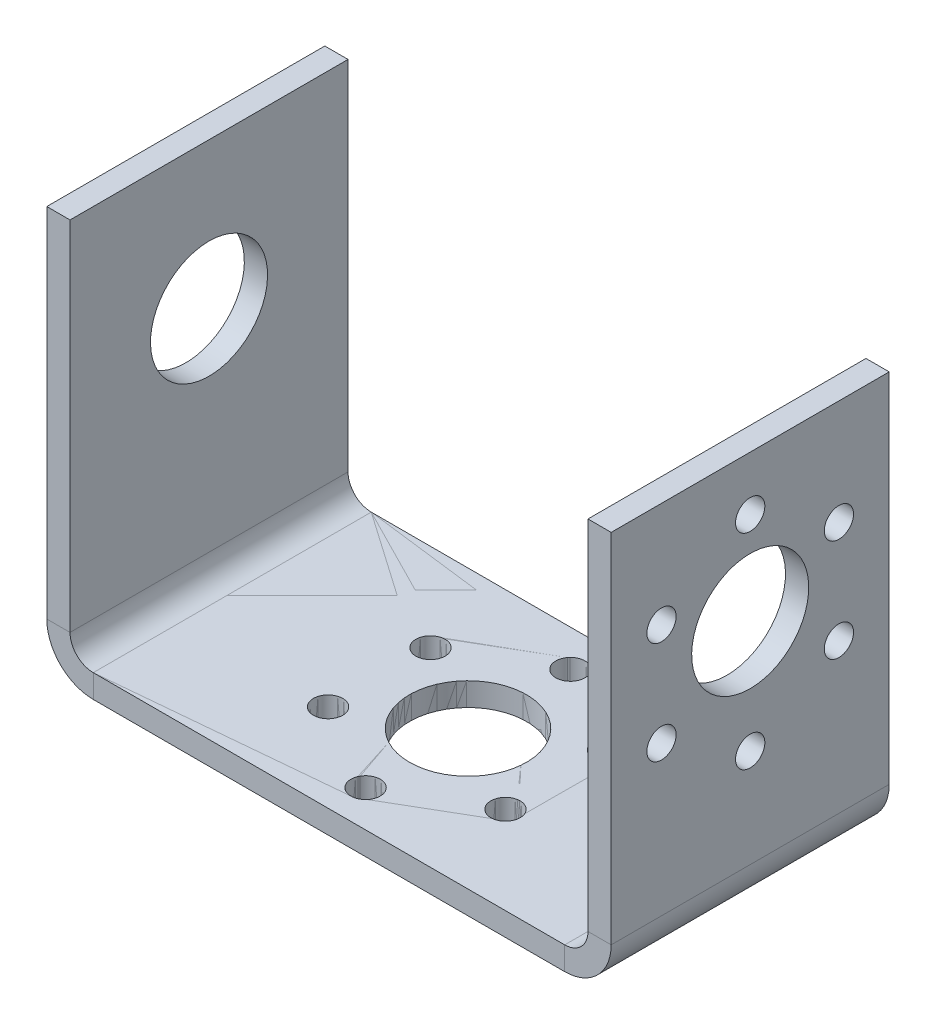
ISO-10303-21;
HEADER;
FILE_DESCRIPTION(('STEP AP214'),'2;1');
FILE_NAME('part.step','',(''),(''),'','','');
FILE_SCHEMA(('AUTOMOTIVE_DESIGN { 1 0 10303 214 1 1 1 1 }'));
ENDSEC;
DATA;
#1=APPLICATION_CONTEXT('core data for automotive mechanical design processes');
#2=APPLICATION_PROTOCOL_DEFINITION('international standard','automotive_design',2000,#1);
#3=PRODUCT_CONTEXT('',#1,'mechanical');
#4=PRODUCT('Part','Part','',(#3));
#5=PRODUCT_RELATED_PRODUCT_CATEGORY('part','',(#4));
#6=PRODUCT_DEFINITION_FORMATION('','',#4);
#7=PRODUCT_DEFINITION_CONTEXT('part definition',#1,'design');
#8=PRODUCT_DEFINITION('design','',#6,#7);
#9=PRODUCT_DEFINITION_SHAPE('','',#8);
#10=(LENGTH_UNIT() NAMED_UNIT(*) SI_UNIT(.MILLI.,.METRE.));
#11=(NAMED_UNIT(*) PLANE_ANGLE_UNIT() SI_UNIT($,.RADIAN.));
#12=(NAMED_UNIT(*) SI_UNIT($,.STERADIAN.) SOLID_ANGLE_UNIT());
#13=UNCERTAINTY_MEASURE_WITH_UNIT(LENGTH_MEASURE(1.E-05),#10,'distance_accuracy_value','');
#14=(GEOMETRIC_REPRESENTATION_CONTEXT(3) GLOBAL_UNCERTAINTY_ASSIGNED_CONTEXT((#13)) GLOBAL_UNIT_ASSIGNED_CONTEXT((#10,
#11,#12)) REPRESENTATION_CONTEXT('',''));
#15=CARTESIAN_POINT('',(0.,0.,0.));
#16=DIRECTION('',(0.,0.,1.));
#17=DIRECTION('',(1.,0.,0.));
#18=AXIS2_PLACEMENT_3D('',#15,#16,#17);
#19=CARTESIAN_POINT('',(0.,1.5875,-19.));
#20=DIRECTION('',(0.,0.,1.));
#21=DIRECTION('',(-1.,0.,0.));
#22=AXIS2_PLACEMENT_3D('',#19,#20,#21);
#23=PLANE('',#22);
#24=DIRECTION('',(0.,1.,0.));
#25=VECTOR('',#24,1.);
#26=CARTESIAN_POINT('',(32.22,1.5875,-19.));
#27=LINE('',#26,#25);
#28=CARTESIAN_POINT('',(32.22,0.,-19.));
#29=VERTEX_POINT('',#28);
#30=CARTESIAN_POINT('',(32.22,1.5875,-19.));
#31=VERTEX_POINT('',#30);
#32=EDGE_CURVE('E117',#29,#31,#27,.T.);
#33=ORIENTED_EDGE('',*,*,#32,.F.);
#34=DIRECTION('',(1.,0.,0.));
#35=VECTOR('',#34,1.);
#36=CARTESIAN_POINT('',(0.,0.,-19.));
#37=LINE('',#36,#35);
#38=CARTESIAN_POINT('',(0.,0.,-19.));
#39=VERTEX_POINT('',#38);
#40=EDGE_CURVE('E290',#29,#39,#37,.F.);
#41=ORIENTED_EDGE('',*,*,#40,.T.);
#42=DIRECTION('',(0.,1.,0.));
#43=VECTOR('',#42,1.);
#44=CARTESIAN_POINT('',(0.,1.5875,-19.));
#45=LINE('',#44,#43);
#46=CARTESIAN_POINT('',(0.,1.5875,-19.));
#47=VERTEX_POINT('',#46);
#48=EDGE_CURVE('E125',#39,#47,#45,.T.);
#49=ORIENTED_EDGE('',*,*,#48,.T.);
#50=DIRECTION('',(-1.,0.,0.));
#51=VECTOR('',#50,1.);
#52=CARTESIAN_POINT('',(0.,1.5875,-19.));
#53=LINE('',#52,#51);
#54=EDGE_CURVE('E189',#31,#47,#53,.T.);
#55=ORIENTED_EDGE('',*,*,#54,.F.);
#56=EDGE_LOOP('',(#33,#41,#49,#55));
#57=FACE_BOUND('',#56,.T.);
#58=ADVANCED_FACE('F107',(#57),#23,.F.);
#59=CARTESIAN_POINT('',(10.0478221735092,1.5875,-5.99999999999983));
#60=DIRECTION('',(0.,1.,0.));
#61=DIRECTION('',(0.,0.,1.));
#62=AXIS2_PLACEMENT_3D('',#59,#60,#61);
#63=CYLINDRICAL_SURFACE('',#62,1.00000000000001);
#64=CARTESIAN_POINT('',(10.0478221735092,1.5875,-5.99999999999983));
#65=DIRECTION('',(0.,1.,0.));
#66=DIRECTION('',(0.,0.,1.));
#67=AXIS2_PLACEMENT_3D('',#64,#65,#66);
#68=CIRCLE('',#67,1.00000000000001);
#69=CARTESIAN_POINT('',(10.0478221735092,1.5875,-4.99999999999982));
#70=VERTEX_POINT('',#69);
#71=EDGE_CURVE('E257',#70,#70,#68,.T.);
#72=ORIENTED_EDGE('',*,*,#71,.T.);
#73=EDGE_LOOP('',(#72));
#74=FACE_BOUND('',#73,.T.);
#75=CARTESIAN_POINT('',(10.0478221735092,0.,-5.99999999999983));
#76=DIRECTION('',(0.,1.,0.));
#77=DIRECTION('',(0.,0.,1.));
#78=AXIS2_PLACEMENT_3D('',#75,#76,#77);
#79=CIRCLE('',#78,1.00000000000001);
#80=CARTESIAN_POINT('',(10.0478221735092,0.,-4.99999999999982));
#81=VERTEX_POINT('',#80);
#82=EDGE_CURVE('E248',#81,#81,#79,.T.);
#83=ORIENTED_EDGE('',*,*,#82,.F.);
#84=EDGE_LOOP('',(#83));
#85=FACE_BOUND('',#84,.T.);
#86=ADVANCED_FACE('F472',(#74,#85),#63,.F.);
#87=CARTESIAN_POINT('',(22.1721778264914,1.5875,-6.00000000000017));
#88=DIRECTION('',(0.,1.,0.));
#89=DIRECTION('',(0.,0.,1.));
#90=AXIS2_PLACEMENT_3D('',#87,#88,#89);
#91=CYLINDRICAL_SURFACE('',#90,1.);
#92=CARTESIAN_POINT('',(22.1721778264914,1.5875,-6.00000000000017));
#93=DIRECTION('',(0.,1.,0.));
#94=DIRECTION('',(0.,0.,1.));
#95=AXIS2_PLACEMENT_3D('',#92,#93,#94);
#96=CIRCLE('',#95,1.);
#97=CARTESIAN_POINT('',(22.1721778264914,1.5875,-5.00000000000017));
#98=VERTEX_POINT('',#97);
#99=EDGE_CURVE('E260',#98,#98,#96,.T.);
#100=ORIENTED_EDGE('',*,*,#99,.T.);
#101=EDGE_LOOP('',(#100));
#102=FACE_BOUND('',#101,.T.);
#103=CARTESIAN_POINT('',(22.1721778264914,0.,-6.00000000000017));
#104=DIRECTION('',(0.,1.,0.));
#105=DIRECTION('',(0.,0.,1.));
#106=AXIS2_PLACEMENT_3D('',#103,#104,#105);
#107=CIRCLE('',#106,1.);
#108=CARTESIAN_POINT('',(22.1721778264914,0.,-5.00000000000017));
#109=VERTEX_POINT('',#108);
#110=EDGE_CURVE('E283',#109,#109,#107,.T.);
#111=ORIENTED_EDGE('',*,*,#110,.F.);
#112=EDGE_LOOP('',(#111));
#113=FACE_BOUND('',#112,.T.);
#114=ADVANCED_FACE('F477',(#102,#113),#91,.F.);
#115=CARTESIAN_POINT('',(16.11,1.5875,-16.5));
#116=DIRECTION('',(0.,1.,0.));
#117=DIRECTION('',(0.,0.,1.));
#118=AXIS2_PLACEMENT_3D('',#115,#116,#117);
#119=CYLINDRICAL_SURFACE('',#118,1.);
#120=CARTESIAN_POINT('',(16.11,1.5875,-16.5));
#121=DIRECTION('',(0.,1.,0.));
#122=DIRECTION('',(0.,0.,1.));
#123=AXIS2_PLACEMENT_3D('',#120,#121,#122);
#124=CIRCLE('',#123,1.);
#125=CARTESIAN_POINT('',(16.11,1.5875,-15.5));
#126=VERTEX_POINT('',#125);
#127=EDGE_CURVE('E264',#126,#126,#124,.T.);
#128=ORIENTED_EDGE('',*,*,#127,.T.);
#129=EDGE_LOOP('',(#128));
#130=FACE_BOUND('',#129,.T.);
#131=CARTESIAN_POINT('',(16.11,0.,-16.5));
#132=DIRECTION('',(0.,1.,0.));
#133=DIRECTION('',(0.,0.,1.));
#134=AXIS2_PLACEMENT_3D('',#131,#132,#133);
#135=CIRCLE('',#134,1.);
#136=CARTESIAN_POINT('',(16.11,0.,-15.5));
#137=VERTEX_POINT('',#136);
#138=EDGE_CURVE('E286',#137,#137,#135,.T.);
#139=ORIENTED_EDGE('',*,*,#138,.F.);
#140=EDGE_LOOP('',(#139));
#141=FACE_BOUND('',#140,.T.);
#142=ADVANCED_FACE('F482',(#130,#141),#119,.F.);
#143=CARTESIAN_POINT('',(0.,1.5875,0.));
#144=DIRECTION('',(0.,0.,-1.));
#145=DIRECTION('',(1.,0.,0.));
#146=AXIS2_PLACEMENT_3D('',#143,#144,#145);
#147=PLANE('',#146);
#148=DIRECTION('',(1.,0.,0.));
#149=VECTOR('',#148,1.);
#150=CARTESIAN_POINT('',(0.,0.,0.));
#151=LINE('',#150,#149);
#152=CARTESIAN_POINT('',(0.,0.,0.));
#153=VERTEX_POINT('',#152);
#154=CARTESIAN_POINT('',(32.22,0.,0.));
#155=VERTEX_POINT('',#154);
#156=EDGE_CURVE('E148',#153,#155,#151,.T.);
#157=ORIENTED_EDGE('',*,*,#156,.T.);
#158=DIRECTION('',(0.,1.,0.));
#159=VECTOR('',#158,1.);
#160=CARTESIAN_POINT('',(32.22,1.5875,0.));
#161=LINE('',#160,#159);
#162=CARTESIAN_POINT('',(32.22,1.5875,0.));
#163=VERTEX_POINT('',#162);
#164=EDGE_CURVE('E14',#155,#163,#161,.T.);
#165=ORIENTED_EDGE('',*,*,#164,.T.);
#166=DIRECTION('',(1.,0.,0.));
#167=VECTOR('',#166,1.);
#168=CARTESIAN_POINT('',(0.,1.5875,0.));
#169=LINE('',#168,#167);
#170=CARTESIAN_POINT('',(0.,1.5875,0.));
#171=VERTEX_POINT('',#170);
#172=EDGE_CURVE('E165',#171,#163,#169,.T.);
#173=ORIENTED_EDGE('',*,*,#172,.F.);
#174=DIRECTION('',(0.,1.,0.));
#175=VECTOR('',#174,1.);
#176=CARTESIAN_POINT('',(0.,1.5875,0.));
#177=LINE('',#176,#175);
#178=EDGE_CURVE('E111',#153,#171,#177,.T.);
#179=ORIENTED_EDGE('',*,*,#178,.F.);
#180=EDGE_LOOP('',(#157,#165,#173,#179));
#181=FACE_BOUND('',#180,.T.);
#182=ADVANCED_FACE('F164',(#181),#147,.F.);
#183=CARTESIAN_POINT('',(16.11,1.5875,-9.5));
#184=DIRECTION('',(0.,1.,0.));
#185=DIRECTION('',(0.,0.,1.));
#186=AXIS2_PLACEMENT_3D('',#183,#184,#185);
#187=CYLINDRICAL_SURFACE('',#186,4.);
#188=CARTESIAN_POINT('',(16.11,1.5875,-9.5));
#189=DIRECTION('',(0.,1.,0.));
#190=DIRECTION('',(0.,0.,1.));
#191=AXIS2_PLACEMENT_3D('',#188,#189,#190);
#192=CIRCLE('',#191,4.);
#193=CARTESIAN_POINT('',(16.11,1.5875,-5.5));
#194=VERTEX_POINT('',#193);
#195=EDGE_CURVE('E269',#194,#194,#192,.T.);
#196=ORIENTED_EDGE('',*,*,#195,.T.);
#197=EDGE_LOOP('',(#196));
#198=FACE_BOUND('',#197,.T.);
#199=CARTESIAN_POINT('',(16.11,0.,-9.5));
#200=DIRECTION('',(0.,1.,0.));
#201=DIRECTION('',(0.,0.,1.));
#202=AXIS2_PLACEMENT_3D('',#199,#200,#201);
#203=CIRCLE('',#202,4.);
#204=CARTESIAN_POINT('',(16.11,0.,-5.5));
#205=VERTEX_POINT('',#204);
#206=EDGE_CURVE('E292',#205,#205,#203,.T.);
#207=ORIENTED_EDGE('',*,*,#206,.F.);
#208=EDGE_LOOP('',(#207));
#209=FACE_BOUND('',#208,.T.);
#210=ADVANCED_FACE('F486',(#198,#209),#187,.F.);
#211=CARTESIAN_POINT('',(22.1721778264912,1.5875,-13.0000000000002));
#212=DIRECTION('',(0.,1.,0.));
#213=DIRECTION('',(0.,0.,1.));
#214=AXIS2_PLACEMENT_3D('',#211,#212,#213);
#215=CYLINDRICAL_SURFACE('',#214,1.);
#216=CARTESIAN_POINT('',(22.1721778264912,1.5875,-13.0000000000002));
#217=DIRECTION('',(0.,1.,0.));
#218=DIRECTION('',(0.,0.,1.));
#219=AXIS2_PLACEMENT_3D('',#216,#217,#218);
#220=CIRCLE('',#219,1.);
#221=CARTESIAN_POINT('',(22.1721778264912,1.5875,-12.0000000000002));
#222=VERTEX_POINT('',#221);
#223=EDGE_CURVE('E272',#222,#222,#220,.T.);
#224=ORIENTED_EDGE('',*,*,#223,.T.);
#225=EDGE_LOOP('',(#224));
#226=FACE_BOUND('',#225,.T.);
#227=CARTESIAN_POINT('',(22.1721778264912,0.,-13.0000000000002));
#228=DIRECTION('',(0.,1.,0.));
#229=DIRECTION('',(0.,0.,1.));
#230=AXIS2_PLACEMENT_3D('',#227,#228,#229);
#231=CIRCLE('',#230,1.);
#232=CARTESIAN_POINT('',(22.1721778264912,0.,-12.0000000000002));
#233=VERTEX_POINT('',#232);
#234=EDGE_CURVE('E297',#233,#233,#231,.T.);
#235=ORIENTED_EDGE('',*,*,#234,.F.);
#236=EDGE_LOOP('',(#235));
#237=FACE_BOUND('',#236,.T.);
#238=ADVANCED_FACE('F489',(#226,#237),#215,.F.);
#239=CARTESIAN_POINT('',(16.1100000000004,1.5875,-2.5));
#240=DIRECTION('',(0.,1.,0.));
#241=DIRECTION('',(0.,0.,1.));
#242=AXIS2_PLACEMENT_3D('',#239,#240,#241);
#243=CYLINDRICAL_SURFACE('',#242,1.00000000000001);
#244=CARTESIAN_POINT('',(16.1100000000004,1.5875,-2.5));
#245=DIRECTION('',(0.,1.,0.));
#246=DIRECTION('',(0.,0.,1.));
#247=AXIS2_PLACEMENT_3D('',#244,#245,#246);
#248=CIRCLE('',#247,1.00000000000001);
#249=CARTESIAN_POINT('',(16.1100000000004,1.5875,-1.49999999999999));
#250=VERTEX_POINT('',#249);
#251=EDGE_CURVE('E275',#250,#250,#248,.T.);
#252=ORIENTED_EDGE('',*,*,#251,.T.);
#253=EDGE_LOOP('',(#252));
#254=FACE_BOUND('',#253,.T.);
#255=CARTESIAN_POINT('',(16.1100000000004,0.,-2.5));
#256=DIRECTION('',(0.,1.,0.));
#257=DIRECTION('',(0.,0.,1.));
#258=AXIS2_PLACEMENT_3D('',#255,#256,#257);
#259=CIRCLE('',#258,1.00000000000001);
#260=CARTESIAN_POINT('',(16.1100000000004,0.,-1.49999999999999));
#261=VERTEX_POINT('',#260);
#262=EDGE_CURVE('E300',#261,#261,#259,.T.);
#263=ORIENTED_EDGE('',*,*,#262,.F.);
#264=EDGE_LOOP('',(#263));
#265=FACE_BOUND('',#264,.T.);
#266=ADVANCED_FACE('F492',(#254,#265),#243,.F.);
#267=CARTESIAN_POINT('',(10.047822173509,1.5875,-12.9999999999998));
#268=DIRECTION('',(0.,1.,0.));
#269=DIRECTION('',(0.,0.,1.));
#270=AXIS2_PLACEMENT_3D('',#267,#268,#269);
#271=CYLINDRICAL_SURFACE('',#270,1.);
#272=CARTESIAN_POINT('',(10.047822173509,1.5875,-12.9999999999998));
#273=DIRECTION('',(0.,1.,0.));
#274=DIRECTION('',(0.,0.,1.));
#275=AXIS2_PLACEMENT_3D('',#272,#273,#274);
#276=CIRCLE('',#275,1.);
#277=CARTESIAN_POINT('',(10.047822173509,1.5875,-11.9999999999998));
#278=VERTEX_POINT('',#277);
#279=EDGE_CURVE('E278',#278,#278,#276,.T.);
#280=ORIENTED_EDGE('',*,*,#279,.T.);
#281=EDGE_LOOP('',(#280));
#282=FACE_BOUND('',#281,.T.);
#283=CARTESIAN_POINT('',(10.047822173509,0.,-12.9999999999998));
#284=DIRECTION('',(0.,1.,0.));
#285=DIRECTION('',(0.,0.,1.));
#286=AXIS2_PLACEMENT_3D('',#283,#284,#285);
#287=CIRCLE('',#286,1.);
#288=CARTESIAN_POINT('',(10.047822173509,0.,-11.9999999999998));
#289=VERTEX_POINT('',#288);
#290=EDGE_CURVE('E261',#289,#289,#287,.T.);
#291=ORIENTED_EDGE('',*,*,#290,.F.);
#292=EDGE_LOOP('',(#291));
#293=FACE_BOUND('',#292,.T.);
#294=ADVANCED_FACE('F109',(#282,#293),#271,.F.);
#295=CARTESIAN_POINT('',(0.,1.5875,0.));
#296=DIRECTION('',(0.,-1.,0.));
#297=DIRECTION('',(0.,0.,-1.));
#298=AXIS2_PLACEMENT_3D('',#295,#296,#297);
#299=PLANE('',#298);
#300=ORIENTED_EDGE('',*,*,#71,.F.);
#301=EDGE_LOOP('',(#300));
#302=FACE_BOUND('',#301,.T.);
#303=ORIENTED_EDGE('',*,*,#99,.F.);
#304=EDGE_LOOP('',(#303));
#305=FACE_BOUND('',#304,.T.);
#306=ORIENTED_EDGE('',*,*,#127,.F.);
#307=EDGE_LOOP('',(#306));
#308=FACE_BOUND('',#307,.T.);
#309=DIRECTION('',(0.,0.,1.));
#310=VECTOR('',#309,1.);
#311=CARTESIAN_POINT('',(0.,1.5875,0.));
#312=LINE('',#311,#310);
#313=EDGE_CURVE('E177',#47,#171,#312,.T.);
#314=ORIENTED_EDGE('',*,*,#313,.T.);
#315=ORIENTED_EDGE('',*,*,#172,.T.);
#316=DIRECTION('',(0.,0.,-1.));
#317=VECTOR('',#316,1.);
#318=CARTESIAN_POINT('',(32.22,1.5875,0.));
#319=LINE('',#318,#317);
#320=EDGE_CURVE('E175',#163,#31,#319,.T.);
#321=ORIENTED_EDGE('',*,*,#320,.T.);
#322=ORIENTED_EDGE('',*,*,#54,.T.);
#323=EDGE_LOOP('',(#314,#315,#321,#322));
#324=FACE_BOUND('',#323,.T.);
#325=ORIENTED_EDGE('',*,*,#195,.F.);
#326=EDGE_LOOP('',(#325));
#327=FACE_BOUND('',#326,.T.);
#328=ORIENTED_EDGE('',*,*,#223,.F.);
#329=EDGE_LOOP('',(#328));
#330=FACE_BOUND('',#329,.T.);
#331=ORIENTED_EDGE('',*,*,#251,.F.);
#332=EDGE_LOOP('',(#331));
#333=FACE_BOUND('',#332,.T.);
#334=ORIENTED_EDGE('',*,*,#279,.F.);
#335=EDGE_LOOP('',(#334));
#336=FACE_BOUND('',#335,.T.);
#337=ADVANCED_FACE('F173',(#302,#305,#308,#324,#327,#330,#333,#336),#299,.F.);
#338=CARTESIAN_POINT('',(0.,0.,0.));
#339=DIRECTION('',(0.,-1.,0.));
#340=DIRECTION('',(0.,0.,-1.));
#341=AXIS2_PLACEMENT_3D('',#338,#339,#340);
#342=PLANE('',#341);
#343=ORIENTED_EDGE('',*,*,#82,.T.);
#344=EDGE_LOOP('',(#343));
#345=FACE_BOUND('',#344,.T.);
#346=ORIENTED_EDGE('',*,*,#110,.T.);
#347=EDGE_LOOP('',(#346));
#348=FACE_BOUND('',#347,.T.);
#349=ORIENTED_EDGE('',*,*,#138,.T.);
#350=EDGE_LOOP('',(#349));
#351=FACE_BOUND('',#350,.T.);
#352=DIRECTION('',(0.,0.,-1.));
#353=VECTOR('',#352,1.);
#354=CARTESIAN_POINT('',(0.,0.,0.));
#355=LINE('',#354,#353);
#356=EDGE_CURVE('E138',#39,#153,#355,.F.);
#357=ORIENTED_EDGE('',*,*,#356,.F.);
#358=ORIENTED_EDGE('',*,*,#40,.F.);
#359=DIRECTION('',(0.,0.,-1.));
#360=VECTOR('',#359,1.);
#361=CARTESIAN_POINT('',(32.22,0.,0.));
#362=LINE('',#361,#360);
#363=EDGE_CURVE('E144',#155,#29,#362,.T.);
#364=ORIENTED_EDGE('',*,*,#363,.F.);
#365=ORIENTED_EDGE('',*,*,#156,.F.);
#366=EDGE_LOOP('',(#357,#358,#364,#365));
#367=FACE_BOUND('',#366,.T.);
#368=ORIENTED_EDGE('',*,*,#206,.T.);
#369=EDGE_LOOP('',(#368));
#370=FACE_BOUND('',#369,.T.);
#371=ORIENTED_EDGE('',*,*,#234,.T.);
#372=EDGE_LOOP('',(#371));
#373=FACE_BOUND('',#372,.T.);
#374=ORIENTED_EDGE('',*,*,#262,.T.);
#375=EDGE_LOOP('',(#374));
#376=FACE_BOUND('',#375,.T.);
#377=ORIENTED_EDGE('',*,*,#290,.T.);
#378=EDGE_LOOP('',(#377));
#379=FACE_BOUND('',#378,.T.);
#380=ADVANCED_FACE('F504',(#345,#348,#351,#367,#370,#373,#376,#379),#342,.T.);
#381=CARTESIAN_POINT('',(0.,3.175,-19.));
#382=DIRECTION('',(0.,0.,-1.));
#383=DIRECTION('',(-1.,0.,0.));
#384=AXIS2_PLACEMENT_3D('',#381,#382,#383);
#385=PLANE('',#384);
#386=DIRECTION('',(1.,0.,0.));
#387=VECTOR('',#386,1.);
#388=CARTESIAN_POINT('',(-3.175,3.17499999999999,-19.));
#389=LINE('',#388,#387);
#390=CARTESIAN_POINT('',(-1.5875,3.17499999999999,-19.));
#391=VERTEX_POINT('',#390);
#392=CARTESIAN_POINT('',(-3.175,3.17499999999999,-19.));
#393=VERTEX_POINT('',#392);
#394=EDGE_CURVE('E242',#391,#393,#389,.F.);
#395=ORIENTED_EDGE('',*,*,#394,.F.);
#396=CARTESIAN_POINT('',(0.,3.175,-19.));
#397=DIRECTION('',(0.,0.,1.));
#398=DIRECTION('',(1.,0.,0.));
#399=AXIS2_PLACEMENT_3D('',#396,#397,#398);
#400=CIRCLE('',#399,1.5875);
#401=EDGE_CURVE('E252',#47,#391,#400,.F.);
#402=ORIENTED_EDGE('',*,*,#401,.F.);
#403=ORIENTED_EDGE('',*,*,#48,.F.);
#404=CARTESIAN_POINT('',(0.,3.175,-19.));
#405=DIRECTION('',(0.,0.,1.));
#406=DIRECTION('',(1.,0.,0.));
#407=AXIS2_PLACEMENT_3D('',#404,#405,#406);
#408=CIRCLE('',#407,3.175);
#409=EDGE_CURVE('E245',#39,#393,#408,.F.);
#410=ORIENTED_EDGE('',*,*,#409,.T.);
#411=EDGE_LOOP('',(#395,#402,#403,#410));
#412=FACE_BOUND('',#411,.T.);
#413=ADVANCED_FACE('F451',(#412),#385,.T.);
#414=CARTESIAN_POINT('',(0.,3.175,0.));
#415=DIRECTION('',(0.,0.,-1.));
#416=DIRECTION('',(-1.,0.,0.));
#417=AXIS2_PLACEMENT_3D('',#414,#415,#416);
#418=PLANE('',#417);
#419=CARTESIAN_POINT('',(0.,3.175,0.));
#420=DIRECTION('',(0.,0.,1.));
#421=DIRECTION('',(1.,0.,0.));
#422=AXIS2_PLACEMENT_3D('',#419,#420,#421);
#423=CIRCLE('',#422,1.5875);
#424=CARTESIAN_POINT('',(-1.5875,3.17499999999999,0.));
#425=VERTEX_POINT('',#424);
#426=EDGE_CURVE('E207',#425,#171,#423,.T.);
#427=ORIENTED_EDGE('',*,*,#426,.F.);
#428=DIRECTION('',(1.,0.,0.));
#429=VECTOR('',#428,1.);
#430=CARTESIAN_POINT('',(-1.5875,3.17499999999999,0.));
#431=LINE('',#430,#429);
#432=CARTESIAN_POINT('',(-3.175,3.17499999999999,0.));
#433=VERTEX_POINT('',#432);
#434=EDGE_CURVE('E237',#425,#433,#431,.F.);
#435=ORIENTED_EDGE('',*,*,#434,.T.);
#436=CARTESIAN_POINT('',(0.,3.175,0.));
#437=DIRECTION('',(0.,0.,1.));
#438=DIRECTION('',(1.,0.,0.));
#439=AXIS2_PLACEMENT_3D('',#436,#437,#438);
#440=CIRCLE('',#439,3.175);
#441=EDGE_CURVE('E249',#433,#153,#440,.T.);
#442=ORIENTED_EDGE('',*,*,#441,.T.);
#443=ORIENTED_EDGE('',*,*,#178,.T.);
#444=EDGE_LOOP('',(#427,#435,#442,#443));
#445=FACE_BOUND('',#444,.T.);
#446=ADVANCED_FACE('F436',(#445),#418,.F.);
#447=CARTESIAN_POINT('',(0.,3.175,0.));
#448=DIRECTION('',(0.,0.,1.));
#449=DIRECTION('',(-1.,0.,0.));
#450=AXIS2_PLACEMENT_3D('',#447,#448,#449);
#451=CYLINDRICAL_SURFACE('',#450,3.175);
#452=ORIENTED_EDGE('',*,*,#356,.T.);
#453=ORIENTED_EDGE('',*,*,#441,.F.);
#454=DIRECTION('',(0.,0.,1.));
#455=VECTOR('',#454,1.);
#456=CARTESIAN_POINT('',(-3.175,3.17499999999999,-19.));
#457=LINE('',#456,#455);
#458=EDGE_CURVE('E235',#433,#393,#457,.F.);
#459=ORIENTED_EDGE('',*,*,#458,.T.);
#460=ORIENTED_EDGE('',*,*,#409,.F.);
#461=EDGE_LOOP('',(#452,#453,#459,#460));
#462=FACE_BOUND('',#461,.T.);
#463=ADVANCED_FACE('F429',(#462),#451,.T.);
#464=CARTESIAN_POINT('',(0.,3.175,0.));
#465=DIRECTION('',(0.,0.,1.));
#466=DIRECTION('',(-1.,0.,0.));
#467=AXIS2_PLACEMENT_3D('',#464,#465,#466);
#468=CYLINDRICAL_SURFACE('',#467,1.5875);
#469=ORIENTED_EDGE('',*,*,#313,.F.);
#470=ORIENTED_EDGE('',*,*,#401,.T.);
#471=DIRECTION('',(0.,0.,1.));
#472=VECTOR('',#471,1.);
#473=CARTESIAN_POINT('',(-1.5875,3.17499999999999,-19.));
#474=LINE('',#473,#472);
#475=EDGE_CURVE('E240',#391,#425,#474,.T.);
#476=ORIENTED_EDGE('',*,*,#475,.T.);
#477=ORIENTED_EDGE('',*,*,#426,.T.);
#478=EDGE_LOOP('',(#469,#470,#476,#477));
#479=FACE_BOUND('',#478,.T.);
#480=ADVANCED_FACE('F454',(#479),#468,.F.);
#481=CARTESIAN_POINT('',(-3.17499999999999,0.,0.));
#482=DIRECTION('',(1.,0.,0.));
#483=DIRECTION('',(0.,1.,0.));
#484=AXIS2_PLACEMENT_3D('',#481,#482,#483);
#485=PLANE('',#484);
#486=CARTESIAN_POINT('',(-3.17500000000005,17.5875,-9.5));
#487=DIRECTION('',(1.,0.,0.));
#488=DIRECTION('',(0.,1.,0.));
#489=AXIS2_PLACEMENT_3D('',#486,#487,#488);
#490=CIRCLE('',#489,4.);
#491=CARTESIAN_POINT('',(-3.17500000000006,21.5875,-9.5));
#492=VERTEX_POINT('',#491);
#493=EDGE_CURVE('E229',#492,#492,#490,.F.);
#494=ORIENTED_EDGE('',*,*,#493,.F.);
#495=EDGE_LOOP('',(#494));
#496=FACE_BOUND('',#495,.T.);
#497=ORIENTED_EDGE('',*,*,#458,.F.);
#498=DIRECTION('',(0.,1.,0.));
#499=VECTOR('',#498,1.);
#500=CARTESIAN_POINT('',(-3.17499999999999,0.,0.));
#501=LINE('',#500,#499);
#502=CARTESIAN_POINT('',(-3.17500000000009,27.5875,0.));
#503=VERTEX_POINT('',#502);
#504=EDGE_CURVE('E214',#433,#503,#501,.T.);
#505=ORIENTED_EDGE('',*,*,#504,.T.);
#506=DIRECTION('',(0.,0.,-1.));
#507=VECTOR('',#506,1.);
#508=CARTESIAN_POINT('',(-3.17500000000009,27.5875,0.));
#509=LINE('',#508,#507);
#510=CARTESIAN_POINT('',(-3.17500000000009,27.5875,-19.));
#511=VERTEX_POINT('',#510);
#512=EDGE_CURVE('E211',#503,#511,#509,.T.);
#513=ORIENTED_EDGE('',*,*,#512,.T.);
#514=DIRECTION('',(0.,-1.,0.));
#515=VECTOR('',#514,1.);
#516=CARTESIAN_POINT('',(-3.17499999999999,0.,-19.));
#517=LINE('',#516,#515);
#518=EDGE_CURVE('E217',#511,#393,#517,.T.);
#519=ORIENTED_EDGE('',*,*,#518,.T.);
#520=EDGE_LOOP('',(#497,#505,#513,#519));
#521=FACE_BOUND('',#520,.T.);
#522=ADVANCED_FACE('F443',(#496,#521),#485,.F.);
#523=CARTESIAN_POINT('',(-1.58749999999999,0.,0.));
#524=DIRECTION('',(1.,0.,0.));
#525=DIRECTION('',(0.,1.,0.));
#526=AXIS2_PLACEMENT_3D('',#523,#524,#525);
#527=PLANE('',#526);
#528=CARTESIAN_POINT('',(-1.58750000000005,17.5875,-9.5));
#529=DIRECTION('',(1.,0.,0.));
#530=DIRECTION('',(0.,1.,0.));
#531=AXIS2_PLACEMENT_3D('',#528,#529,#530);
#532=CIRCLE('',#531,4.);
#533=CARTESIAN_POINT('',(-1.58750000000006,21.5875,-9.5));
#534=VERTEX_POINT('',#533);
#535=EDGE_CURVE('E232',#534,#534,#532,.F.);
#536=ORIENTED_EDGE('',*,*,#535,.T.);
#537=EDGE_LOOP('',(#536));
#538=FACE_BOUND('',#537,.T.);
#539=DIRECTION('',(0.,-1.,0.));
#540=VECTOR('',#539,1.);
#541=CARTESIAN_POINT('',(-1.58750000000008,27.5875,0.));
#542=LINE('',#541,#540);
#543=CARTESIAN_POINT('',(-1.58750000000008,27.5875,0.));
#544=VERTEX_POINT('',#543);
#545=EDGE_CURVE('E223',#425,#544,#542,.F.);
#546=ORIENTED_EDGE('',*,*,#545,.F.);
#547=ORIENTED_EDGE('',*,*,#475,.F.);
#548=DIRECTION('',(0.,1.,0.));
#549=VECTOR('',#548,1.);
#550=CARTESIAN_POINT('',(-1.58749999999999,1.5875,-19.));
#551=LINE('',#550,#549);
#552=CARTESIAN_POINT('',(-1.58750000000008,27.5875,-19.));
#553=VERTEX_POINT('',#552);
#554=EDGE_CURVE('E226',#553,#391,#551,.F.);
#555=ORIENTED_EDGE('',*,*,#554,.F.);
#556=DIRECTION('',(0.,0.,1.));
#557=VECTOR('',#556,1.);
#558=CARTESIAN_POINT('',(-1.58750000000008,27.5875,-19.));
#559=LINE('',#558,#557);
#560=EDGE_CURVE('E220',#544,#553,#559,.F.);
#561=ORIENTED_EDGE('',*,*,#560,.F.);
#562=EDGE_LOOP('',(#546,#547,#555,#561));
#563=FACE_BOUND('',#562,.T.);
#564=ADVANCED_FACE('F456',(#538,#563),#527,.T.);
#565=CARTESIAN_POINT('',(-3.17499999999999,1.58749999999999,-19.));
#566=DIRECTION('',(0.,0.,1.));
#567=DIRECTION('',(1.,0.,0.));
#568=AXIS2_PLACEMENT_3D('',#565,#566,#567);
#569=PLANE('',#568);
#570=ORIENTED_EDGE('',*,*,#394,.T.);
#571=ORIENTED_EDGE('',*,*,#518,.F.);
#572=DIRECTION('',(1.,0.,0.));
#573=VECTOR('',#572,1.);
#574=CARTESIAN_POINT('',(-3.17500000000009,27.5875,-19.));
#575=LINE('',#574,#573);
#576=EDGE_CURVE('E208',#511,#553,#575,.T.);
#577=ORIENTED_EDGE('',*,*,#576,.T.);
#578=ORIENTED_EDGE('',*,*,#554,.T.);
#579=EDGE_LOOP('',(#570,#571,#577,#578));
#580=FACE_BOUND('',#579,.T.);
#581=ADVANCED_FACE('F447',(#580),#569,.F.);
#582=CARTESIAN_POINT('',(-3.17500000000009,27.5875,0.));
#583=DIRECTION('',(0.,0.,-1.));
#584=DIRECTION('',(0.,1.,0.));
#585=AXIS2_PLACEMENT_3D('',#582,#583,#584);
#586=PLANE('',#585);
#587=ORIENTED_EDGE('',*,*,#434,.F.);
#588=ORIENTED_EDGE('',*,*,#545,.T.);
#589=DIRECTION('',(1.,0.,0.));
#590=VECTOR('',#589,1.);
#591=CARTESIAN_POINT('',(-3.17500000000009,27.5875,0.));
#592=LINE('',#591,#590);
#593=EDGE_CURVE('E204',#503,#544,#592,.T.);
#594=ORIENTED_EDGE('',*,*,#593,.F.);
#595=ORIENTED_EDGE('',*,*,#504,.F.);
#596=EDGE_LOOP('',(#587,#588,#594,#595));
#597=FACE_BOUND('',#596,.T.);
#598=ADVANCED_FACE('F440',(#597),#586,.F.);
#599=CARTESIAN_POINT('',(-3.17500000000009,27.5875,-19.));
#600=DIRECTION('',(0.,-1.,0.));
#601=DIRECTION('',(1.,0.,0.));
#602=AXIS2_PLACEMENT_3D('',#599,#600,#601);
#603=PLANE('',#602);
#604=ORIENTED_EDGE('',*,*,#560,.T.);
#605=ORIENTED_EDGE('',*,*,#576,.F.);
#606=ORIENTED_EDGE('',*,*,#512,.F.);
#607=ORIENTED_EDGE('',*,*,#593,.T.);
#608=EDGE_LOOP('',(#604,#605,#606,#607));
#609=FACE_BOUND('',#608,.T.);
#610=ADVANCED_FACE('F459',(#609),#603,.F.);
#611=CARTESIAN_POINT('',(-3.17500000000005,17.5875,-9.5));
#612=DIRECTION('',(1.,0.,0.));
#613=DIRECTION('',(0.,1.,0.));
#614=AXIS2_PLACEMENT_3D('',#611,#612,#613);
#615=CYLINDRICAL_SURFACE('',#614,4.);
#616=ORIENTED_EDGE('',*,*,#493,.T.);
#617=EDGE_LOOP('',(#616));
#618=FACE_BOUND('',#617,.T.);
#619=ORIENTED_EDGE('',*,*,#535,.F.);
#620=EDGE_LOOP('',(#619));
#621=FACE_BOUND('',#620,.T.);
#622=ADVANCED_FACE('F461',(#618,#621),#615,.F.);
#623=CARTESIAN_POINT('',(32.22,3.175,0.));
#624=DIRECTION('',(0.,0.,1.));
#625=DIRECTION('',(1.,0.,0.));
#626=AXIS2_PLACEMENT_3D('',#623,#624,#625);
#627=PLANE('',#626);
#628=DIRECTION('',(-1.,0.,0.));
#629=VECTOR('',#628,1.);
#630=CARTESIAN_POINT('',(35.395,3.17499999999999,0.));
#631=LINE('',#630,#629);
#632=CARTESIAN_POINT('',(33.8075,3.17499999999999,0.));
#633=VERTEX_POINT('',#632);
#634=CARTESIAN_POINT('',(35.395,3.17499999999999,0.));
#635=VERTEX_POINT('',#634);
#636=EDGE_CURVE('E194',#633,#635,#631,.F.);
#637=ORIENTED_EDGE('',*,*,#636,.F.);
#638=CARTESIAN_POINT('',(32.22,3.175,0.));
#639=DIRECTION('',(0.,0.,-1.));
#640=DIRECTION('',(-1.,0.,0.));
#641=AXIS2_PLACEMENT_3D('',#638,#639,#640);
#642=CIRCLE('',#641,1.5875);
#643=EDGE_CURVE('E185',#163,#633,#642,.F.);
#644=ORIENTED_EDGE('',*,*,#643,.F.);
#645=ORIENTED_EDGE('',*,*,#164,.F.);
#646=CARTESIAN_POINT('',(32.22,3.175,0.));
#647=DIRECTION('',(0.,0.,-1.));
#648=DIRECTION('',(-1.,0.,0.));
#649=AXIS2_PLACEMENT_3D('',#646,#647,#648);
#650=CIRCLE('',#649,3.175);
#651=EDGE_CURVE('E198',#155,#635,#650,.F.);
#652=ORIENTED_EDGE('',*,*,#651,.T.);
#653=EDGE_LOOP('',(#637,#644,#645,#652));
#654=FACE_BOUND('',#653,.T.);
#655=ADVANCED_FACE('F192',(#654),#627,.T.);
#656=CARTESIAN_POINT('',(32.22,3.175,-19.));
#657=DIRECTION('',(0.,0.,1.));
#658=DIRECTION('',(1.,0.,0.));
#659=AXIS2_PLACEMENT_3D('',#656,#657,#658);
#660=PLANE('',#659);
#661=CARTESIAN_POINT('',(32.22,3.175,-19.));
#662=DIRECTION('',(0.,0.,-1.));
#663=DIRECTION('',(-1.,0.,0.));
#664=AXIS2_PLACEMENT_3D('',#661,#662,#663);
#665=CIRCLE('',#664,1.5875);
#666=CARTESIAN_POINT('',(33.8075,3.17499999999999,-19.));
#667=VERTEX_POINT('',#666);
#668=EDGE_CURVE('E188',#667,#31,#665,.T.);
#669=ORIENTED_EDGE('',*,*,#668,.F.);
#670=DIRECTION('',(-1.,0.,0.));
#671=VECTOR('',#670,1.);
#672=CARTESIAN_POINT('',(33.8075,3.17499999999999,-19.));
#673=LINE('',#672,#671);
#674=CARTESIAN_POINT('',(35.395,3.17499999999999,-19.));
#675=VERTEX_POINT('',#674);
#676=EDGE_CURVE('E328',#667,#675,#673,.F.);
#677=ORIENTED_EDGE('',*,*,#676,.T.);
#678=CARTESIAN_POINT('',(32.22,3.175,-19.));
#679=DIRECTION('',(0.,0.,-1.));
#680=DIRECTION('',(-1.,0.,0.));
#681=AXIS2_PLACEMENT_3D('',#678,#679,#680);
#682=CIRCLE('',#681,3.175);
#683=EDGE_CURVE('E195',#675,#29,#682,.T.);
#684=ORIENTED_EDGE('',*,*,#683,.T.);
#685=ORIENTED_EDGE('',*,*,#32,.T.);
#686=EDGE_LOOP('',(#669,#677,#684,#685));
#687=FACE_BOUND('',#686,.T.);
#688=ADVANCED_FACE('F309',(#687),#660,.F.);
#689=CARTESIAN_POINT('',(32.22,3.175,-19.));
#690=DIRECTION('',(0.,0.,-1.));
#691=DIRECTION('',(1.,0.,0.));
#692=AXIS2_PLACEMENT_3D('',#689,#690,#691);
#693=CYLINDRICAL_SURFACE('',#692,3.175);
#694=ORIENTED_EDGE('',*,*,#363,.T.);
#695=ORIENTED_EDGE('',*,*,#683,.F.);
#696=DIRECTION('',(0.,0.,-1.));
#697=VECTOR('',#696,1.);
#698=CARTESIAN_POINT('',(35.395,3.17499999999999,0.));
#699=LINE('',#698,#697);
#700=EDGE_CURVE('E323',#675,#635,#699,.F.);
#701=ORIENTED_EDGE('',*,*,#700,.T.);
#702=ORIENTED_EDGE('',*,*,#651,.F.);
#703=EDGE_LOOP('',(#694,#695,#701,#702));
#704=FACE_BOUND('',#703,.T.);
#705=ADVANCED_FACE('F319',(#704),#693,.T.);
#706=CARTESIAN_POINT('',(32.22,3.175,-19.));
#707=DIRECTION('',(0.,0.,-1.));
#708=DIRECTION('',(1.,0.,0.));
#709=AXIS2_PLACEMENT_3D('',#706,#707,#708);
#710=CYLINDRICAL_SURFACE('',#709,1.5875);
#711=ORIENTED_EDGE('',*,*,#320,.F.);
#712=ORIENTED_EDGE('',*,*,#643,.T.);
#713=DIRECTION('',(0.,0.,-1.));
#714=VECTOR('',#713,1.);
#715=CARTESIAN_POINT('',(33.8075,3.17499999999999,0.));
#716=LINE('',#715,#714);
#717=EDGE_CURVE('E326',#633,#667,#716,.T.);
#718=ORIENTED_EDGE('',*,*,#717,.T.);
#719=ORIENTED_EDGE('',*,*,#668,.T.);
#720=EDGE_LOOP('',(#711,#712,#718,#719));
#721=FACE_BOUND('',#720,.T.);
#722=ADVANCED_FACE('F182',(#721),#710,.F.);
#723=CARTESIAN_POINT('',(35.395,-1.17328307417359E-13,0.));
#724=DIRECTION('',(-1.,0.,0.));
#725=DIRECTION('',(0.,-1.,0.));
#726=AXIS2_PLACEMENT_3D('',#723,#724,#725);
#727=PLANE('',#726);
#728=CARTESIAN_POINT('',(35.3950000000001,20.3975604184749,-3.43782217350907));
#729=DIRECTION('',(-1.,0.,0.));
#730=DIRECTION('',(0.,-1.,0.));
#731=AXIS2_PLACEMENT_3D('',#728,#729,#730);
#732=CIRCLE('',#731,1.);
#733=CARTESIAN_POINT('',(35.395,19.3975604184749,-3.43782217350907));
#734=VERTEX_POINT('',#733);
#735=EDGE_CURVE('E334',#734,#734,#732,.F.);
#736=ORIENTED_EDGE('',*,*,#735,.F.);
#737=EDGE_LOOP('',(#736));
#738=FACE_BOUND('',#737,.T.);
#739=CARTESIAN_POINT('',(35.395,9.89756041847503,-9.50000000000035));
#740=DIRECTION('',(-1.,0.,0.));
#741=DIRECTION('',(0.,-1.,0.));
#742=AXIS2_PLACEMENT_3D('',#739,#740,#741);
#743=CIRCLE('',#742,1.);
#744=CARTESIAN_POINT('',(35.395,8.89756041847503,-9.50000000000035));
#745=VERTEX_POINT('',#744);
#746=EDGE_CURVE('E346',#745,#745,#743,.F.);
#747=ORIENTED_EDGE('',*,*,#746,.F.);
#748=EDGE_LOOP('',(#747));
#749=FACE_BOUND('',#748,.T.);
#750=CARTESIAN_POINT('',(35.3950000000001,20.3975604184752,-15.5621778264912));
#751=DIRECTION('',(-1.,0.,0.));
#752=DIRECTION('',(0.,-1.,0.));
#753=AXIS2_PLACEMENT_3D('',#750,#751,#752);
#754=CIRCLE('',#753,0.999999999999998);
#755=CARTESIAN_POINT('',(35.3950000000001,19.3975604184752,-15.5621778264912));
#756=VERTEX_POINT('',#755);
#757=EDGE_CURVE('E358',#756,#756,#754,.F.);
#758=ORIENTED_EDGE('',*,*,#757,.F.);
#759=EDGE_LOOP('',(#758));
#760=FACE_BOUND('',#759,.T.);
#761=CARTESIAN_POINT('',(35.395,17.5875,-9.5));
#762=DIRECTION('',(-1.,0.,0.));
#763=DIRECTION('',(0.,-1.,0.));
#764=AXIS2_PLACEMENT_3D('',#761,#762,#763);
#765=CIRCLE('',#764,4.);
#766=CARTESIAN_POINT('',(35.395,13.5875,-9.5));
#767=VERTEX_POINT('',#766);
#768=EDGE_CURVE('E370',#767,#767,#765,.F.);
#769=ORIENTED_EDGE('',*,*,#768,.F.);
#770=EDGE_LOOP('',(#769));
#771=FACE_BOUND('',#770,.T.);
#772=CARTESIAN_POINT('',(35.3950000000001,23.897560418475,-9.5));
#773=DIRECTION('',(-1.,0.,0.));
#774=DIRECTION('',(0.,-1.,0.));
#775=AXIS2_PLACEMENT_3D('',#772,#773,#774);
#776=CIRCLE('',#775,1.);
#777=CARTESIAN_POINT('',(35.3950000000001,22.897560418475,-9.5));
#778=VERTEX_POINT('',#777);
#779=EDGE_CURVE('E364',#778,#778,#776,.F.);
#780=ORIENTED_EDGE('',*,*,#779,.F.);
#781=EDGE_LOOP('',(#780));
#782=FACE_BOUND('',#781,.T.);
#783=CARTESIAN_POINT('',(35.395,13.3975604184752,-15.5621778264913));
#784=DIRECTION('',(-1.,0.,0.));
#785=DIRECTION('',(0.,-1.,0.));
#786=AXIS2_PLACEMENT_3D('',#783,#784,#785);
#787=CIRCLE('',#786,1.);
#788=CARTESIAN_POINT('',(35.395,12.3975604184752,-15.5621778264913));
#789=VERTEX_POINT('',#788);
#790=EDGE_CURVE('E352',#789,#789,#787,.F.);
#791=ORIENTED_EDGE('',*,*,#790,.F.);
#792=EDGE_LOOP('',(#791));
#793=FACE_BOUND('',#792,.T.);
#794=CARTESIAN_POINT('',(35.395,13.3975604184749,-3.43782217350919));
#795=DIRECTION('',(-1.,0.,0.));
#796=DIRECTION('',(0.,-1.,0.));
#797=AXIS2_PLACEMENT_3D('',#794,#795,#796);
#798=CIRCLE('',#797,1.);
#799=CARTESIAN_POINT('',(35.395,12.3975604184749,-3.43782217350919));
#800=VERTEX_POINT('',#799);
#801=EDGE_CURVE('E340',#800,#800,#798,.F.);
#802=ORIENTED_EDGE('',*,*,#801,.F.);
#803=EDGE_LOOP('',(#802));
#804=FACE_BOUND('',#803,.T.);
#805=ORIENTED_EDGE('',*,*,#700,.F.);
#806=DIRECTION('',(0.,1.,0.));
#807=VECTOR('',#806,1.);
#808=CARTESIAN_POINT('',(35.395,-1.12257577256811E-13,-19.));
#809=LINE('',#808,#807);
#810=CARTESIAN_POINT('',(35.3950000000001,27.5875,-19.));
#811=VERTEX_POINT('',#810);
#812=EDGE_CURVE('E381',#675,#811,#809,.T.);
#813=ORIENTED_EDGE('',*,*,#812,.T.);
#814=DIRECTION('',(0.,0.,1.));
#815=VECTOR('',#814,1.);
#816=CARTESIAN_POINT('',(35.3950000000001,27.5875,0.));
#817=LINE('',#816,#815);
#818=CARTESIAN_POINT('',(35.3950000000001,27.5875,0.));
#819=VERTEX_POINT('',#818);
#820=EDGE_CURVE('E384',#811,#819,#817,.T.);
#821=ORIENTED_EDGE('',*,*,#820,.T.);
#822=DIRECTION('',(0.,-1.,0.));
#823=VECTOR('',#822,1.);
#824=CARTESIAN_POINT('',(35.395,-1.17328307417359E-13,0.));
#825=LINE('',#824,#823);
#826=EDGE_CURVE('E387',#819,#635,#825,.T.);
#827=ORIENTED_EDGE('',*,*,#826,.T.);
#828=EDGE_LOOP('',(#805,#813,#821,#827));
#829=FACE_BOUND('',#828,.T.);
#830=ADVANCED_FACE('F750',(#738,#749,#760,#771,#782,#793,#804,#829),#727,.F.);
#831=CARTESIAN_POINT('',(33.8075,-1.11785580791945E-13,0.));
#832=DIRECTION('',(-1.,0.,0.));
#833=DIRECTION('',(0.,-1.,0.));
#834=AXIS2_PLACEMENT_3D('',#831,#832,#833);
#835=PLANE('',#834);
#836=CARTESIAN_POINT('',(33.8075000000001,20.3975604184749,-3.43782217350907));
#837=DIRECTION('',(-1.,0.,0.));
#838=DIRECTION('',(0.,-1.,0.));
#839=AXIS2_PLACEMENT_3D('',#836,#837,#838);
#840=CIRCLE('',#839,1.);
#841=CARTESIAN_POINT('',(33.8075,19.3975604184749,-3.43782217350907));
#842=VERTEX_POINT('',#841);
#843=EDGE_CURVE('E331',#842,#842,#840,.F.);
#844=ORIENTED_EDGE('',*,*,#843,.T.);
#845=EDGE_LOOP('',(#844));
#846=FACE_BOUND('',#845,.T.);
#847=CARTESIAN_POINT('',(33.8075,9.89756041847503,-9.50000000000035));
#848=DIRECTION('',(-1.,0.,0.));
#849=DIRECTION('',(0.,-1.,0.));
#850=AXIS2_PLACEMENT_3D('',#847,#848,#849);
#851=CIRCLE('',#850,1.);
#852=CARTESIAN_POINT('',(33.8075,8.89756041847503,-9.50000000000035));
#853=VERTEX_POINT('',#852);
#854=EDGE_CURVE('E343',#853,#853,#851,.F.);
#855=ORIENTED_EDGE('',*,*,#854,.T.);
#856=EDGE_LOOP('',(#855));
#857=FACE_BOUND('',#856,.T.);
#858=CARTESIAN_POINT('',(33.8075000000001,20.3975604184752,-15.5621778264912));
#859=DIRECTION('',(-1.,0.,0.));
#860=DIRECTION('',(0.,-1.,0.));
#861=AXIS2_PLACEMENT_3D('',#858,#859,#860);
#862=CIRCLE('',#861,0.999999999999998);
#863=CARTESIAN_POINT('',(33.8075000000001,19.3975604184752,-15.5621778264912));
#864=VERTEX_POINT('',#863);
#865=EDGE_CURVE('E355',#864,#864,#862,.F.);
#866=ORIENTED_EDGE('',*,*,#865,.T.);
#867=EDGE_LOOP('',(#866));
#868=FACE_BOUND('',#867,.T.);
#869=CARTESIAN_POINT('',(33.8075,17.5875,-9.5));
#870=DIRECTION('',(-1.,0.,0.));
#871=DIRECTION('',(0.,-1.,0.));
#872=AXIS2_PLACEMENT_3D('',#869,#870,#871);
#873=CIRCLE('',#872,4.);
#874=CARTESIAN_POINT('',(33.8075,13.5875,-9.5));
#875=VERTEX_POINT('',#874);
#876=EDGE_CURVE('E367',#875,#875,#873,.F.);
#877=ORIENTED_EDGE('',*,*,#876,.T.);
#878=EDGE_LOOP('',(#877));
#879=FACE_BOUND('',#878,.T.);
#880=CARTESIAN_POINT('',(33.8075000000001,23.897560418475,-9.5));
#881=DIRECTION('',(-1.,0.,0.));
#882=DIRECTION('',(0.,-1.,0.));
#883=AXIS2_PLACEMENT_3D('',#880,#881,#882);
#884=CIRCLE('',#883,1.);
#885=CARTESIAN_POINT('',(33.8075000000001,22.897560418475,-9.5));
#886=VERTEX_POINT('',#885);
#887=EDGE_CURVE('E361',#886,#886,#884,.F.);
#888=ORIENTED_EDGE('',*,*,#887,.T.);
#889=EDGE_LOOP('',(#888));
#890=FACE_BOUND('',#889,.T.);
#891=CARTESIAN_POINT('',(33.8075,13.3975604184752,-15.5621778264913));
#892=DIRECTION('',(-1.,0.,0.));
#893=DIRECTION('',(0.,-1.,0.));
#894=AXIS2_PLACEMENT_3D('',#891,#892,#893);
#895=CIRCLE('',#894,1.);
#896=CARTESIAN_POINT('',(33.8075,12.3975604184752,-15.5621778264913));
#897=VERTEX_POINT('',#896);
#898=EDGE_CURVE('E349',#897,#897,#895,.F.);
#899=ORIENTED_EDGE('',*,*,#898,.T.);
#900=EDGE_LOOP('',(#899));
#901=FACE_BOUND('',#900,.T.);
#902=CARTESIAN_POINT('',(33.8075,13.3975604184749,-3.43782217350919));
#903=DIRECTION('',(-1.,0.,0.));
#904=DIRECTION('',(0.,-1.,0.));
#905=AXIS2_PLACEMENT_3D('',#902,#903,#904);
#906=CIRCLE('',#905,1.);
#907=CARTESIAN_POINT('',(33.8075,12.3975604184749,-3.43782217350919));
#908=VERTEX_POINT('',#907);
#909=EDGE_CURVE('E337',#908,#908,#906,.F.);
#910=ORIENTED_EDGE('',*,*,#909,.T.);
#911=EDGE_LOOP('',(#910));
#912=FACE_BOUND('',#911,.T.);
#913=DIRECTION('',(0.,-1.,0.));
#914=VECTOR('',#913,1.);
#915=CARTESIAN_POINT('',(33.8075000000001,27.5875,-19.));
#916=LINE('',#915,#914);
#917=CARTESIAN_POINT('',(33.8075000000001,27.5875,-19.));
#918=VERTEX_POINT('',#917);
#919=EDGE_CURVE('E373',#667,#918,#916,.F.);
#920=ORIENTED_EDGE('',*,*,#919,.F.);
#921=ORIENTED_EDGE('',*,*,#717,.F.);
#922=DIRECTION('',(0.,1.,0.));
#923=VECTOR('',#922,1.);
#924=CARTESIAN_POINT('',(33.8075,1.5875,0.));
#925=LINE('',#924,#923);
#926=CARTESIAN_POINT('',(33.8075000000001,27.5875,0.));
#927=VERTEX_POINT('',#926);
#928=EDGE_CURVE('E379',#927,#633,#925,.F.);
#929=ORIENTED_EDGE('',*,*,#928,.F.);
#930=DIRECTION('',(0.,0.,-1.));
#931=VECTOR('',#930,1.);
#932=CARTESIAN_POINT('',(33.8075000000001,27.5875,0.));
#933=LINE('',#932,#931);
#934=EDGE_CURVE('E376',#918,#927,#933,.F.);
#935=ORIENTED_EDGE('',*,*,#934,.F.);
#936=EDGE_LOOP('',(#920,#921,#929,#935));
#937=FACE_BOUND('',#936,.T.);
#938=ADVANCED_FACE('F409',(#846,#857,#868,#879,#890,#901,#912,#937),#835,.T.);
#939=CARTESIAN_POINT('',(35.3950000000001,27.5875,-19.));
#940=DIRECTION('',(0.,0.,1.));
#941=DIRECTION('',(0.,-1.,0.));
#942=AXIS2_PLACEMENT_3D('',#939,#940,#941);
#943=PLANE('',#942);
#944=ORIENTED_EDGE('',*,*,#676,.F.);
#945=ORIENTED_EDGE('',*,*,#919,.T.);
#946=DIRECTION('',(-1.,0.,0.));
#947=VECTOR('',#946,1.);
#948=CARTESIAN_POINT('',(35.3950000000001,27.5875,-19.));
#949=LINE('',#948,#947);
#950=EDGE_CURVE('E200',#811,#918,#949,.T.);
#951=ORIENTED_EDGE('',*,*,#950,.F.);
#952=ORIENTED_EDGE('',*,*,#812,.F.);
#953=EDGE_LOOP('',(#944,#945,#951,#952));
#954=FACE_BOUND('',#953,.T.);
#955=ADVANCED_FACE('F768',(#954),#943,.F.);
#956=CARTESIAN_POINT('',(35.395,1.58749999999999,0.));
#957=DIRECTION('',(0.,0.,-1.));
#958=DIRECTION('',(-1.,0.,0.));
#959=AXIS2_PLACEMENT_3D('',#956,#957,#958);
#960=PLANE('',#959);
#961=ORIENTED_EDGE('',*,*,#636,.T.);
#962=ORIENTED_EDGE('',*,*,#826,.F.);
#963=DIRECTION('',(-1.,0.,0.));
#964=VECTOR('',#963,1.);
#965=CARTESIAN_POINT('',(35.3950000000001,27.5875,0.));
#966=LINE('',#965,#964);
#967=EDGE_CURVE('E390',#819,#927,#966,.T.);
#968=ORIENTED_EDGE('',*,*,#967,.T.);
#969=ORIENTED_EDGE('',*,*,#928,.T.);
#970=EDGE_LOOP('',(#961,#962,#968,#969));
#971=FACE_BOUND('',#970,.T.);
#972=ADVANCED_FACE('F413',(#971),#960,.F.);
#973=CARTESIAN_POINT('',(35.3950000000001,27.5875,0.));
#974=DIRECTION('',(0.,-1.,0.));
#975=DIRECTION('',(1.,0.,0.));
#976=AXIS2_PLACEMENT_3D('',#973,#974,#975);
#977=PLANE('',#976);
#978=ORIENTED_EDGE('',*,*,#934,.T.);
#979=ORIENTED_EDGE('',*,*,#967,.F.);
#980=ORIENTED_EDGE('',*,*,#820,.F.);
#981=ORIENTED_EDGE('',*,*,#950,.T.);
#982=EDGE_LOOP('',(#978,#979,#980,#981));
#983=FACE_BOUND('',#982,.T.);
#984=ADVANCED_FACE('F399',(#983),#977,.F.);
#985=CARTESIAN_POINT('',(35.395,17.5875,-9.5));
#986=DIRECTION('',(-1.,0.,0.));
#987=DIRECTION('',(0.,-1.,0.));
#988=AXIS2_PLACEMENT_3D('',#985,#986,#987);
#989=CYLINDRICAL_SURFACE('',#988,4.);
#990=ORIENTED_EDGE('',*,*,#768,.T.);
#991=EDGE_LOOP('',(#990));
#992=FACE_BOUND('',#991,.T.);
#993=ORIENTED_EDGE('',*,*,#876,.F.);
#994=EDGE_LOOP('',(#993));
#995=FACE_BOUND('',#994,.T.);
#996=ADVANCED_FACE('F794',(#992,#995),#989,.F.);
#997=CARTESIAN_POINT('',(35.3950000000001,23.897560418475,-9.5));
#998=DIRECTION('',(-1.,0.,0.));
#999=DIRECTION('',(0.,-1.,0.));
#1000=AXIS2_PLACEMENT_3D('',#997,#998,#999);
#1001=CYLINDRICAL_SURFACE('',#1000,1.);
#1002=ORIENTED_EDGE('',*,*,#779,.T.);
#1003=EDGE_LOOP('',(#1002));
#1004=FACE_BOUND('',#1003,.T.);
#1005=ORIENTED_EDGE('',*,*,#887,.F.);
#1006=EDGE_LOOP('',(#1005));
#1007=FACE_BOUND('',#1006,.T.);
#1008=ADVANCED_FACE('F803',(#1004,#1007),#1001,.F.);
#1009=CARTESIAN_POINT('',(35.3950000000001,20.3975604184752,-15.5621778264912));
#1010=DIRECTION('',(-1.,0.,0.));
#1011=DIRECTION('',(0.,-1.,0.));
#1012=AXIS2_PLACEMENT_3D('',#1009,#1010,#1011);
#1013=CYLINDRICAL_SURFACE('',#1012,0.999999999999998);
#1014=ORIENTED_EDGE('',*,*,#757,.T.);
#1015=EDGE_LOOP('',(#1014));
#1016=FACE_BOUND('',#1015,.T.);
#1017=ORIENTED_EDGE('',*,*,#865,.F.);
#1018=EDGE_LOOP('',(#1017));
#1019=FACE_BOUND('',#1018,.T.);
#1020=ADVANCED_FACE('F813',(#1016,#1019),#1013,.F.);
#1021=CARTESIAN_POINT('',(35.395,13.3975604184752,-15.5621778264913));
#1022=DIRECTION('',(-1.,0.,0.));
#1023=DIRECTION('',(0.,-1.,0.));
#1024=AXIS2_PLACEMENT_3D('',#1021,#1022,#1023);
#1025=CYLINDRICAL_SURFACE('',#1024,1.);
#1026=ORIENTED_EDGE('',*,*,#790,.T.);
#1027=EDGE_LOOP('',(#1026));
#1028=FACE_BOUND('',#1027,.T.);
#1029=ORIENTED_EDGE('',*,*,#898,.F.);
#1030=EDGE_LOOP('',(#1029));
#1031=FACE_BOUND('',#1030,.T.);
#1032=ADVANCED_FACE('F823',(#1028,#1031),#1025,.F.);
#1033=CARTESIAN_POINT('',(35.395,9.89756041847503,-9.50000000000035));
#1034=DIRECTION('',(-1.,0.,0.));
#1035=DIRECTION('',(0.,-1.,0.));
#1036=AXIS2_PLACEMENT_3D('',#1033,#1034,#1035);
#1037=CYLINDRICAL_SURFACE('',#1036,1.);
#1038=ORIENTED_EDGE('',*,*,#746,.T.);
#1039=EDGE_LOOP('',(#1038));
#1040=FACE_BOUND('',#1039,.T.);
#1041=ORIENTED_EDGE('',*,*,#854,.F.);
#1042=EDGE_LOOP('',(#1041));
#1043=FACE_BOUND('',#1042,.T.);
#1044=ADVANCED_FACE('F833',(#1040,#1043),#1037,.F.);
#1045=CARTESIAN_POINT('',(35.395,13.3975604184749,-3.43782217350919));
#1046=DIRECTION('',(-1.,0.,0.));
#1047=DIRECTION('',(0.,-1.,0.));
#1048=AXIS2_PLACEMENT_3D('',#1045,#1046,#1047);
#1049=CYLINDRICAL_SURFACE('',#1048,1.);
#1050=ORIENTED_EDGE('',*,*,#801,.T.);
#1051=EDGE_LOOP('',(#1050));
#1052=FACE_BOUND('',#1051,.T.);
#1053=ORIENTED_EDGE('',*,*,#909,.F.);
#1054=EDGE_LOOP('',(#1053));
#1055=FACE_BOUND('',#1054,.T.);
#1056=ADVANCED_FACE('F843',(#1052,#1055),#1049,.F.);
#1057=CARTESIAN_POINT('',(35.3950000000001,20.3975604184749,-3.43782217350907));
#1058=DIRECTION('',(-1.,0.,0.));
#1059=DIRECTION('',(0.,-1.,0.));
#1060=AXIS2_PLACEMENT_3D('',#1057,#1058,#1059);
#1061=CYLINDRICAL_SURFACE('',#1060,1.);
#1062=ORIENTED_EDGE('',*,*,#735,.T.);
#1063=EDGE_LOOP('',(#1062));
#1064=FACE_BOUND('',#1063,.T.);
#1065=ORIENTED_EDGE('',*,*,#843,.F.);
#1066=EDGE_LOOP('',(#1065));
#1067=FACE_BOUND('',#1066,.T.);
#1068=ADVANCED_FACE('F853',(#1064,#1067),#1061,.F.);
#1069=CLOSED_SHELL('',(#58,#86,#114,#142,#182,#210,#238,#266,#294,#337,#380,#413,#446,#463,#480,
#522,#564,#581,#598,#610,#622,#655,#688,#705,#722,#830,#938,#955,#972,#984,#996,#1008,#1020,
#1032,#1044,#1056,#1068));
#1070=MANIFOLD_SOLID_BREP('B2',#1069);
#1071=CARTESIAN_POINT('',(0.,1.5875,0.));
#1072=DIRECTION('',(0.,-1.,0.));
#1073=DIRECTION('',(0.,0.,-1.));
#1074=AXIS2_PLACEMENT_3D('',#1071,#1072,#1073);
#1075=PLANE('',#1074);
#1076=CARTESIAN_POINT('',(10.0478221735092,1.5875,-5.99999999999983));
#1077=DIRECTION('',(0.,1.,0.));
#1078=DIRECTION('',(0.,0.,1.));
#1079=AXIS2_PLACEMENT_3D('',#1076,#1077,#1078);
#1080=CIRCLE('',#1079,1.00000000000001);
#1081=CARTESIAN_POINT('',(10.0478221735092,1.5875,-4.99999999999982));
#1082=VERTEX_POINT('',#1081);
#1083=EDGE_CURVE('E1081',#1082,#1082,#1080,.T.);
#1084=ORIENTED_EDGE('',*,*,#1083,.F.);
#1085=EDGE_LOOP('',(#1084));
#1086=FACE_BOUND('',#1085,.T.);
#1087=CARTESIAN_POINT('',(22.1721778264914,1.5875,-6.00000000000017));
#1088=DIRECTION('',(0.,1.,0.));
#1089=DIRECTION('',(0.,0.,1.));
#1090=AXIS2_PLACEMENT_3D('',#1087,#1088,#1089);
#1091=CIRCLE('',#1090,1.);
#1092=CARTESIAN_POINT('',(22.1721778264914,1.5875,-5.00000000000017));
#1093=VERTEX_POINT('',#1092);
#1094=EDGE_CURVE('E1067',#1093,#1093,#1091,.T.);
#1095=ORIENTED_EDGE('',*,*,#1094,.F.);
#1096=EDGE_LOOP('',(#1095));
#1097=FACE_BOUND('',#1096,.T.);
#1098=CARTESIAN_POINT('',(16.11,1.5875,-16.5));
#1099=DIRECTION('',(0.,1.,0.));
#1100=DIRECTION('',(0.,0.,1.));
#1101=AXIS2_PLACEMENT_3D('',#1098,#1099,#1100);
#1102=CIRCLE('',#1101,1.);
#1103=CARTESIAN_POINT('',(16.11,1.5875,-15.5));
#1104=VERTEX_POINT('',#1103);
#1105=EDGE_CURVE('E1054',#1104,#1104,#1102,.T.);
#1106=ORIENTED_EDGE('',*,*,#1105,.F.);
#1107=EDGE_LOOP('',(#1106));
#1108=FACE_BOUND('',#1107,.T.);
#1109=DIRECTION('',(0.,0.,1.));
#1110=VECTOR('',#1109,1.);
#1111=CARTESIAN_POINT('',(0.,1.5875,0.));
#1112=LINE('',#1111,#1110);
#1113=CARTESIAN_POINT('',(0.,1.5875,-19.));
#1114=VERTEX_POINT('',#1113);
#1115=CARTESIAN_POINT('',(0.,1.5875,0.));
#1116=VERTEX_POINT('',#1115);
#1117=EDGE_CURVE('E1019',#1114,#1116,#1112,.T.);
#1118=ORIENTED_EDGE('',*,*,#1117,.T.);
#1119=DIRECTION('',(1.,0.,0.));
#1120=VECTOR('',#1119,1.);
#1121=CARTESIAN_POINT('',(0.,1.5875,0.));
#1122=LINE('',#1121,#1120);
#1123=CARTESIAN_POINT('',(32.22,1.5875,0.));
#1124=VERTEX_POINT('',#1123);
#1125=EDGE_CURVE('E1014',#1116,#1124,#1122,.T.);
#1126=ORIENTED_EDGE('',*,*,#1125,.T.);
#1127=DIRECTION('',(0.,0.,-1.));
#1128=VECTOR('',#1127,1.);
#1129=CARTESIAN_POINT('',(32.22,1.5875,0.));
#1130=LINE('',#1129,#1128);
#1131=CARTESIAN_POINT('',(32.22,1.5875,-19.));
#1132=VERTEX_POINT('',#1131);
#1133=EDGE_CURVE('E1017',#1124,#1132,#1130,.T.);
#1134=ORIENTED_EDGE('',*,*,#1133,.T.);
#1135=DIRECTION('',(-1.,0.,0.));
#1136=VECTOR('',#1135,1.);
#1137=CARTESIAN_POINT('',(0.,1.5875,-19.));
#1138=LINE('',#1137,#1136);
#1139=EDGE_CURVE('E984',#1132,#1114,#1138,.T.);
#1140=ORIENTED_EDGE('',*,*,#1139,.T.);
#1141=EDGE_LOOP('',(#1118,#1126,#1134,#1140));
#1142=FACE_BOUND('',#1141,.T.);
#1143=CARTESIAN_POINT('',(16.11,1.5875,-9.5));
#1144=DIRECTION('',(0.,1.,0.));
#1145=DIRECTION('',(0.,0.,1.));
#1146=AXIS2_PLACEMENT_3D('',#1143,#1144,#1145);
#1147=CIRCLE('',#1146,4.);
#1148=CARTESIAN_POINT('',(16.11,1.5875,-5.5));
#1149=VERTEX_POINT('',#1148);
#1150=EDGE_CURVE('E1037',#1149,#1149,#1147,.T.);
#1151=ORIENTED_EDGE('',*,*,#1150,.F.);
#1152=EDGE_LOOP('',(#1151));
#1153=FACE_BOUND('',#1152,.T.);
#1154=CARTESIAN_POINT('',(22.1721778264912,1.5875,-13.0000000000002));
#1155=DIRECTION('',(0.,1.,0.));
#1156=DIRECTION('',(0.,0.,1.));
#1157=AXIS2_PLACEMENT_3D('',#1154,#1155,#1156);
#1158=CIRCLE('',#1157,1.);
#1159=CARTESIAN_POINT('',(22.1721778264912,1.5875,-12.0000000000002));
#1160=VERTEX_POINT('',#1159);
#1161=EDGE_CURVE('E1061',#1160,#1160,#1158,.T.);
#1162=ORIENTED_EDGE('',*,*,#1161,.F.);
#1163=EDGE_LOOP('',(#1162));
#1164=FACE_BOUND('',#1163,.T.);
#1165=CARTESIAN_POINT('',(16.1100000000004,1.5875,-2.5));
#1166=DIRECTION('',(0.,1.,0.));
#1167=DIRECTION('',(0.,0.,1.));
#1168=AXIS2_PLACEMENT_3D('',#1165,#1166,#1167);
#1169=CIRCLE('',#1168,1.00000000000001);
#1170=CARTESIAN_POINT('',(16.1100000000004,1.5875,-1.49999999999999));
#1171=VERTEX_POINT('',#1170);
#1172=EDGE_CURVE('E1074',#1171,#1171,#1169,.T.);
#1173=ORIENTED_EDGE('',*,*,#1172,.F.);
#1174=EDGE_LOOP('',(#1173));
#1175=FACE_BOUND('',#1174,.T.);
#1176=CARTESIAN_POINT('',(10.047822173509,1.5875,-12.9999999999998));
#1177=DIRECTION('',(0.,1.,0.));
#1178=DIRECTION('',(0.,0.,1.));
#1179=AXIS2_PLACEMENT_3D('',#1176,#1177,#1178);
#1180=CIRCLE('',#1179,1.);
#1181=CARTESIAN_POINT('',(10.047822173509,1.5875,-11.9999999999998));
#1182=VERTEX_POINT('',#1181);
#1183=EDGE_CURVE('E1088',#1182,#1182,#1180,.T.);
#1184=ORIENTED_EDGE('',*,*,#1183,.F.);
#1185=EDGE_LOOP('',(#1184));
#1186=FACE_BOUND('',#1185,.T.);
#1187=ADVANCED_FACE('F967',(#1086,#1097,#1108,#1142,#1153,#1164,#1175,#1186),#1075,.F.);
#1188=CARTESIAN_POINT('',(0.,0.,0.));
#1189=DIRECTION('',(0.,-1.,0.));
#1190=DIRECTION('',(0.,0.,-1.));
#1191=AXIS2_PLACEMENT_3D('',#1188,#1189,#1190);
#1192=PLANE('',#1191);
#1193=CARTESIAN_POINT('',(10.0478221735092,0.,-5.99999999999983));
#1194=DIRECTION('',(0.,1.,0.));
#1195=DIRECTION('',(0.,0.,1.));
#1196=AXIS2_PLACEMENT_3D('',#1193,#1194,#1195);
#1197=CIRCLE('',#1196,1.00000000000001);
#1198=CARTESIAN_POINT('',(10.0478221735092,0.,-4.99999999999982));
#1199=VERTEX_POINT('',#1198);
#1200=EDGE_CURVE('E1085',#1199,#1199,#1197,.T.);
#1201=ORIENTED_EDGE('',*,*,#1200,.T.);
#1202=EDGE_LOOP('',(#1201));
#1203=FACE_BOUND('',#1202,.T.);
#1204=CARTESIAN_POINT('',(22.1721778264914,0.,-6.00000000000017));
#1205=DIRECTION('',(0.,1.,0.));
#1206=DIRECTION('',(0.,0.,1.));
#1207=AXIS2_PLACEMENT_3D('',#1204,#1205,#1206);
#1208=CIRCLE('',#1207,1.);
#1209=CARTESIAN_POINT('',(22.1721778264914,0.,-5.00000000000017));
#1210=VERTEX_POINT('',#1209);
#1211=EDGE_CURVE('E1071',#1210,#1210,#1208,.T.);
#1212=ORIENTED_EDGE('',*,*,#1211,.T.);
#1213=EDGE_LOOP('',(#1212));
#1214=FACE_BOUND('',#1213,.T.);
#1215=CARTESIAN_POINT('',(16.11,0.,-16.5));
#1216=DIRECTION('',(0.,1.,0.));
#1217=DIRECTION('',(0.,0.,1.));
#1218=AXIS2_PLACEMENT_3D('',#1215,#1216,#1217);
#1219=CIRCLE('',#1218,1.);
#1220=CARTESIAN_POINT('',(16.11,0.,-15.5));
#1221=VERTEX_POINT('',#1220);
#1222=EDGE_CURVE('E1058',#1221,#1221,#1219,.T.);
#1223=ORIENTED_EDGE('',*,*,#1222,.T.);
#1224=EDGE_LOOP('',(#1223));
#1225=FACE_BOUND('',#1224,.T.);
#1226=DIRECTION('',(0.,0.,1.));
#1227=VECTOR('',#1226,1.);
#1228=CARTESIAN_POINT('',(0.,0.,0.));
#1229=LINE('',#1228,#1227);
#1230=CARTESIAN_POINT('',(0.,0.,-19.));
#1231=VERTEX_POINT('',#1230);
#1232=CARTESIAN_POINT('',(0.,0.,0.));
#1233=VERTEX_POINT('',#1232);
#1234=EDGE_CURVE('E1034',#1231,#1233,#1229,.T.);
#1235=ORIENTED_EDGE('',*,*,#1234,.F.);
#1236=DIRECTION('',(-1.,0.,0.));
#1237=VECTOR('',#1236,1.);
#1238=CARTESIAN_POINT('',(0.,0.,-19.));
#1239=LINE('',#1238,#1237);
#1240=CARTESIAN_POINT('',(32.22,0.,-19.));
#1241=VERTEX_POINT('',#1240);
#1242=EDGE_CURVE('E1007',#1241,#1231,#1239,.T.);
#1243=ORIENTED_EDGE('',*,*,#1242,.F.);
#1244=DIRECTION('',(0.,0.,-1.));
#1245=VECTOR('',#1244,1.);
#1246=CARTESIAN_POINT('',(32.22,0.,0.));
#1247=LINE('',#1246,#1245);
#1248=CARTESIAN_POINT('',(32.22,0.,0.));
#1249=VERTEX_POINT('',#1248);
#1250=EDGE_CURVE('E1001',#1249,#1241,#1247,.T.);
#1251=ORIENTED_EDGE('',*,*,#1250,.F.);
#1252=DIRECTION('',(1.,0.,0.));
#1253=VECTOR('',#1252,1.);
#1254=CARTESIAN_POINT('',(0.,0.,0.));
#1255=LINE('',#1254,#1253);
#1256=EDGE_CURVE('E1024',#1233,#1249,#1255,.T.);
#1257=ORIENTED_EDGE('',*,*,#1256,.F.);
#1258=EDGE_LOOP('',(#1235,#1243,#1251,#1257));
#1259=FACE_BOUND('',#1258,.T.);
#1260=CARTESIAN_POINT('',(16.11,0.,-9.5));
#1261=DIRECTION('',(0.,1.,0.));
#1262=DIRECTION('',(0.,0.,1.));
#1263=AXIS2_PLACEMENT_3D('',#1260,#1261,#1262);
#1264=CIRCLE('',#1263,4.);
#1265=CARTESIAN_POINT('',(16.11,0.,-5.5));
#1266=VERTEX_POINT('',#1265);
#1267=EDGE_CURVE('E1051',#1266,#1266,#1264,.T.);
#1268=ORIENTED_EDGE('',*,*,#1267,.T.);
#1269=EDGE_LOOP('',(#1268));
#1270=FACE_BOUND('',#1269,.T.);
#1271=CARTESIAN_POINT('',(22.1721778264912,0.,-13.0000000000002));
#1272=DIRECTION('',(0.,1.,0.));
#1273=DIRECTION('',(0.,0.,1.));
#1274=AXIS2_PLACEMENT_3D('',#1271,#1272,#1273);
#1275=CIRCLE('',#1274,1.);
#1276=CARTESIAN_POINT('',(22.1721778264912,0.,-12.0000000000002));
#1277=VERTEX_POINT('',#1276);
#1278=EDGE_CURVE('E1064',#1277,#1277,#1275,.T.);
#1279=ORIENTED_EDGE('',*,*,#1278,.T.);
#1280=EDGE_LOOP('',(#1279));
#1281=FACE_BOUND('',#1280,.T.);
#1282=CARTESIAN_POINT('',(16.1100000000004,0.,-2.5));
#1283=DIRECTION('',(0.,1.,0.));
#1284=DIRECTION('',(0.,0.,1.));
#1285=AXIS2_PLACEMENT_3D('',#1282,#1283,#1284);
#1286=CIRCLE('',#1285,1.00000000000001);
#1287=CARTESIAN_POINT('',(16.1100000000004,0.,-1.49999999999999));
#1288=VERTEX_POINT('',#1287);
#1289=EDGE_CURVE('E1078',#1288,#1288,#1286,.T.);
#1290=ORIENTED_EDGE('',*,*,#1289,.T.);
#1291=EDGE_LOOP('',(#1290));
#1292=FACE_BOUND('',#1291,.T.);
#1293=CARTESIAN_POINT('',(10.047822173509,0.,-12.9999999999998));
#1294=DIRECTION('',(0.,1.,0.));
#1295=DIRECTION('',(0.,0.,1.));
#1296=AXIS2_PLACEMENT_3D('',#1293,#1294,#1295);
#1297=CIRCLE('',#1296,1.);
#1298=CARTESIAN_POINT('',(10.047822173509,0.,-11.9999999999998));
#1299=VERTEX_POINT('',#1298);
#1300=EDGE_CURVE('E1092',#1299,#1299,#1297,.T.);
#1301=ORIENTED_EDGE('',*,*,#1300,.T.);
#1302=EDGE_LOOP('',(#1301));
#1303=FACE_BOUND('',#1302,.T.);
#1304=ADVANCED_FACE('F1045',(#1203,#1214,#1225,#1259,#1270,#1281,#1292,#1303),#1192,.T.);
#1305=CARTESIAN_POINT('',(0.,1.5875,0.));
#1306=DIRECTION('',(1.,0.,0.));
#1307=DIRECTION('',(0.,0.,-1.));
#1308=AXIS2_PLACEMENT_3D('',#1305,#1306,#1307);
#1309=PLANE('',#1308);
#1310=ORIENTED_EDGE('',*,*,#1234,.T.);
#1311=DIRECTION('',(0.,-1.,0.));
#1312=VECTOR('',#1311,1.);
#1313=CARTESIAN_POINT('',(0.,1.5875,0.));
#1314=LINE('',#1313,#1312);
#1315=EDGE_CURVE('E105',#1116,#1233,#1314,.T.);
#1316=ORIENTED_EDGE('',*,*,#1315,.F.);
#1317=ORIENTED_EDGE('',*,*,#1117,.F.);
#1318=DIRECTION('',(0.,-1.,0.));
#1319=VECTOR('',#1318,1.);
#1320=CARTESIAN_POINT('',(0.,1.5875,-19.));
#1321=LINE('',#1320,#1319);
#1322=EDGE_CURVE('E1030',#1114,#1231,#1321,.T.);
#1323=ORIENTED_EDGE('',*,*,#1322,.T.);
#1324=EDGE_LOOP('',(#1310,#1316,#1317,#1323));
#1325=FACE_BOUND('',#1324,.T.);
#1326=ADVANCED_FACE('F969',(#1325),#1309,.F.);
#1327=CARTESIAN_POINT('',(0.,1.5875,0.));
#1328=DIRECTION('',(0.,0.,-1.));
#1329=DIRECTION('',(-1.,0.,0.));
#1330=AXIS2_PLACEMENT_3D('',#1327,#1328,#1329);
#1331=PLANE('',#1330);
#1332=ORIENTED_EDGE('',*,*,#1256,.T.);
#1333=DIRECTION('',(0.,-1.,0.));
#1334=VECTOR('',#1333,1.);
#1335=CARTESIAN_POINT('',(32.22,1.5875,0.));
#1336=LINE('',#1335,#1334);
#1337=EDGE_CURVE('E976',#1124,#1249,#1336,.T.);
#1338=ORIENTED_EDGE('',*,*,#1337,.F.);
#1339=ORIENTED_EDGE('',*,*,#1125,.F.);
#1340=ORIENTED_EDGE('',*,*,#1315,.T.);
#1341=EDGE_LOOP('',(#1332,#1338,#1339,#1340));
#1342=FACE_BOUND('',#1341,.T.);
#1343=ADVANCED_FACE('F1023',(#1342),#1331,.F.);
#1344=CARTESIAN_POINT('',(32.22,1.5875,0.));
#1345=DIRECTION('',(-1.,0.,0.));
#1346=DIRECTION('',(0.,0.,1.));
#1347=AXIS2_PLACEMENT_3D('',#1344,#1345,#1346);
#1348=PLANE('',#1347);
#1349=ORIENTED_EDGE('',*,*,#1250,.T.);
#1350=DIRECTION('',(0.,-1.,0.));
#1351=VECTOR('',#1350,1.);
#1352=CARTESIAN_POINT('',(32.22,1.5875,-19.));
#1353=LINE('',#1352,#1351);
#1354=EDGE_CURVE('E1025',#1132,#1241,#1353,.T.);
#1355=ORIENTED_EDGE('',*,*,#1354,.F.);
#1356=ORIENTED_EDGE('',*,*,#1133,.F.);
#1357=ORIENTED_EDGE('',*,*,#1337,.T.);
#1358=EDGE_LOOP('',(#1349,#1355,#1356,#1357));
#1359=FACE_BOUND('',#1358,.T.);
#1360=ADVANCED_FACE('F1026',(#1359),#1348,.F.);
#1361=CARTESIAN_POINT('',(0.,1.5875,-19.));
#1362=DIRECTION('',(0.,0.,1.));
#1363=DIRECTION('',(1.,0.,0.));
#1364=AXIS2_PLACEMENT_3D('',#1361,#1362,#1363);
#1365=PLANE('',#1364);
#1366=ORIENTED_EDGE('',*,*,#1242,.T.);
#1367=ORIENTED_EDGE('',*,*,#1322,.F.);
#1368=ORIENTED_EDGE('',*,*,#1139,.F.);
#1369=ORIENTED_EDGE('',*,*,#1354,.T.);
#1370=EDGE_LOOP('',(#1366,#1367,#1368,#1369));
#1371=FACE_BOUND('',#1370,.T.);
#1372=ADVANCED_FACE('F1042',(#1371),#1365,.F.);
#1373=CARTESIAN_POINT('',(16.11,1.5875,-9.5));
#1374=DIRECTION('',(0.,-1.,0.));
#1375=DIRECTION('',(0.,0.,-1.));
#1376=AXIS2_PLACEMENT_3D('',#1373,#1374,#1375);
#1377=CYLINDRICAL_SURFACE('',#1376,4.);
#1378=ORIENTED_EDGE('',*,*,#1150,.T.);
#1379=EDGE_LOOP('',(#1378));
#1380=FACE_BOUND('',#1379,.T.);
#1381=ORIENTED_EDGE('',*,*,#1267,.F.);
#1382=EDGE_LOOP('',(#1381));
#1383=FACE_BOUND('',#1382,.T.);
#1384=ADVANCED_FACE('F1113',(#1380,#1383),#1377,.F.);
#1385=CARTESIAN_POINT('',(16.11,1.5875,-16.5));
#1386=DIRECTION('',(0.,-1.,0.));
#1387=DIRECTION('',(0.,0.,-1.));
#1388=AXIS2_PLACEMENT_3D('',#1385,#1386,#1387);
#1389=CYLINDRICAL_SURFACE('',#1388,1.);
#1390=ORIENTED_EDGE('',*,*,#1105,.T.);
#1391=EDGE_LOOP('',(#1390));
#1392=FACE_BOUND('',#1391,.T.);
#1393=ORIENTED_EDGE('',*,*,#1222,.F.);
#1394=EDGE_LOOP('',(#1393));
#1395=FACE_BOUND('',#1394,.T.);
#1396=ADVANCED_FACE('F1159',(#1392,#1395),#1389,.F.);
#1397=CARTESIAN_POINT('',(22.1721778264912,1.5875,-13.0000000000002));
#1398=DIRECTION('',(0.,-1.,0.));
#1399=DIRECTION('',(0.,0.,-1.));
#1400=AXIS2_PLACEMENT_3D('',#1397,#1398,#1399);
#1401=CYLINDRICAL_SURFACE('',#1400,1.);
#1402=ORIENTED_EDGE('',*,*,#1161,.T.);
#1403=EDGE_LOOP('',(#1402));
#1404=FACE_BOUND('',#1403,.T.);
#1405=ORIENTED_EDGE('',*,*,#1278,.F.);
#1406=EDGE_LOOP('',(#1405));
#1407=FACE_BOUND('',#1406,.T.);
#1408=ADVANCED_FACE('F1167',(#1404,#1407),#1401,.F.);
#1409=CARTESIAN_POINT('',(22.1721778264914,1.5875,-6.00000000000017));
#1410=DIRECTION('',(0.,-1.,0.));
#1411=DIRECTION('',(0.,0.,-1.));
#1412=AXIS2_PLACEMENT_3D('',#1409,#1410,#1411);
#1413=CYLINDRICAL_SURFACE('',#1412,1.);
#1414=ORIENTED_EDGE('',*,*,#1094,.T.);
#1415=EDGE_LOOP('',(#1414));
#1416=FACE_BOUND('',#1415,.T.);
#1417=ORIENTED_EDGE('',*,*,#1211,.F.);
#1418=EDGE_LOOP('',(#1417));
#1419=FACE_BOUND('',#1418,.T.);
#1420=ADVANCED_FACE('F1175',(#1416,#1419),#1413,.F.);
#1421=CARTESIAN_POINT('',(16.1100000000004,1.5875,-2.5));
#1422=DIRECTION('',(0.,-1.,0.));
#1423=DIRECTION('',(0.,0.,-1.));
#1424=AXIS2_PLACEMENT_3D('',#1421,#1422,#1423);
#1425=CYLINDRICAL_SURFACE('',#1424,1.00000000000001);
#1426=ORIENTED_EDGE('',*,*,#1172,.T.);
#1427=EDGE_LOOP('',(#1426));
#1428=FACE_BOUND('',#1427,.T.);
#1429=ORIENTED_EDGE('',*,*,#1289,.F.);
#1430=EDGE_LOOP('',(#1429));
#1431=FACE_BOUND('',#1430,.T.);
#1432=ADVANCED_FACE('F1184',(#1428,#1431),#1425,.F.);
#1433=CARTESIAN_POINT('',(10.0478221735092,1.5875,-5.99999999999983));
#1434=DIRECTION('',(0.,-1.,0.));
#1435=DIRECTION('',(0.,0.,-1.));
#1436=AXIS2_PLACEMENT_3D('',#1433,#1434,#1435);
#1437=CYLINDRICAL_SURFACE('',#1436,1.00000000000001);
#1438=ORIENTED_EDGE('',*,*,#1083,.T.);
#1439=EDGE_LOOP('',(#1438));
#1440=FACE_BOUND('',#1439,.T.);
#1441=ORIENTED_EDGE('',*,*,#1200,.F.);
#1442=EDGE_LOOP('',(#1441));
#1443=FACE_BOUND('',#1442,.T.);
#1444=ADVANCED_FACE('F1193',(#1440,#1443),#1437,.F.);
#1445=CARTESIAN_POINT('',(10.047822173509,1.5875,-12.9999999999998));
#1446=DIRECTION('',(0.,-1.,0.));
#1447=DIRECTION('',(0.,0.,-1.));
#1448=AXIS2_PLACEMENT_3D('',#1445,#1446,#1447);
#1449=CYLINDRICAL_SURFACE('',#1448,1.);
#1450=ORIENTED_EDGE('',*,*,#1183,.T.);
#1451=EDGE_LOOP('',(#1450));
#1452=FACE_BOUND('',#1451,.T.);
#1453=ORIENTED_EDGE('',*,*,#1300,.F.);
#1454=EDGE_LOOP('',(#1453));
#1455=FACE_BOUND('',#1454,.T.);
#1456=ADVANCED_FACE('F1099',(#1452,#1455),#1449,.F.);
#1457=CLOSED_SHELL('',(#1187,#1304,#1326,#1343,#1360,#1372,#1384,#1396,#1408,#1420,#1432,#1444,#1456));
#1458=MANIFOLD_SOLID_BREP('B8',#1457);
#1459=ADVANCED_BREP_SHAPE_REPRESENTATION('',(#18,#1070,#1458),#14);
#1460=SHAPE_DEFINITION_REPRESENTATION(#9,#1459);
ENDSEC;
END-ISO-10303-21;
